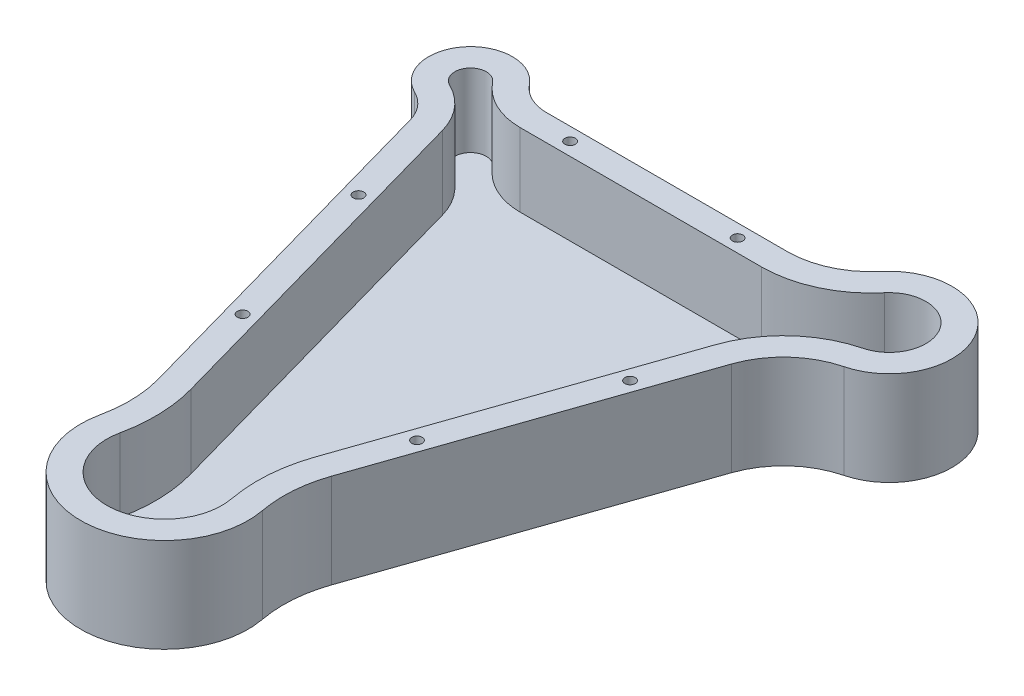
from build123d import *

# Parameters (mm, degrees)
EXTRUDE1_DEPTH                    = 12.7
EXTRUDE_THIN1_DEPTH               = 44.45
F_1_4_28_TAPPED_HOLE1_D           = 5.4102
F_1_4_28_TAPPED_HOLE1_DEPTH       = 15.4202892
F_1_4_28_TAPPED_HOLE1_CBORE_D     = 6.35
F_1_4_28_TAPPED_HOLE1_CBORE_DEPTH = 12.7
F_1_4_28_TAPPED_HOLE1_TIP         = 1.625388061


with BuildPart() as part:
    # Sketch1 → Extrude1 (new body)
    with BuildSketch(Plane(origin=(0, 0, 0), x_dir=(1, 0, 0), z_dir=(0, 1, 0))):
        with BuildLine():
            Line((-110.513625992, 62.787241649), (-50.818057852, -149.612506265))
            ThreePointArc((-50.818057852, -149.612506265), (-48.013269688, -167.841417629), (-49.670330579, -186.210255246))
            ThreePointArc((-49.670330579, -186.210255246), (-0.600829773, -247.660258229), (49.908423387, -187.388091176))
            ThreePointArc((49.908423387, -187.388091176), (48.772721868, -167.634399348), (52.761194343, -148.254248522))
            Line((52.761194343, -148.254248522), (115.169402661, 32.081197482))
            ThreePointArc((115.169402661, 32.081197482), (128.78764256, 52.858628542), (150.629826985, 64.694044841))
            ThreePointArc((150.629826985, 64.694044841), (173.479085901, 121.886333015), (112.036143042, 126.106668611))
            ThreePointArc((112.036143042, 126.106668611), (94.590967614, 112.722401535), (73.124049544, 107.963811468))
            Line((73.124049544, 107.963811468), (-73.124049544, 107.963811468))
            ThreePointArc((-73.124049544, 107.963811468), (-84.122572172, 110.468560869), (-92.951918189, 117.488811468))
            ThreePointArc((-92.951918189, 117.488811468), (-132.6284813, 117.462764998), (-123.873001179, 78.764290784))
            ThreePointArc((-123.873001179, 78.764290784), (-115.480513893, 72.207941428), (-110.513625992, 62.787241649))
        make_face()
    extrude(amount=EXTRUDE1_DEPTH)

    # Sketch2 → Extrude-Thin1 (add)
    with BuildSketch(Plane(origin=(0, 12.7, 0), x_dir=(-1, 0, 0), z_dir=(0, 1, 0))):
        with BuildLine():
            Line((-73.124049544, -107.963811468), (73.124049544, -107.963811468))
            ThreePointArc((73.124049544, -107.963811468), (84.122572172, -110.468560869), (92.951918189, -117.488811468))
            ThreePointArc((92.951918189, -117.488811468), (132.6284813, -117.462764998), (123.873001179, -78.764290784))
            ThreePointArc((123.873001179, -78.764290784), (115.480513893, -72.207941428), (110.513625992, -62.787241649))
            Line((110.513625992, -62.787241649), (50.818057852, 149.612506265))
            ThreePointArc((50.818057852, 149.612506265), (48.013269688, 167.841417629), (49.670330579, 186.210255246))
            ThreePointArc((49.670330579, 186.210255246), (0.600829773, 247.660258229), (-49.908423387, 187.388091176))
            ThreePointArc((-49.908423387, 187.388091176), (-48.772721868, 167.634399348), (-52.761194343, 148.254248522))
            Line((-52.761194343, 148.254248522), (-115.169402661, -32.081197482))
            ThreePointArc((-115.169402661, -32.081197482), (-128.78764256, -52.858628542), (-150.629826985, -64.694044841))
            ThreePointArc((-150.629826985, -64.694044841), (-173.479085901, -121.886333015), (-112.036143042, -126.106668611))
            ThreePointArc((-112.036143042, -126.106668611), (-94.590967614, -112.722401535), (-73.124049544, -107.963811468))
        make_face()
        with BuildLine():
            Line((-73.124049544, -92.088811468), (73.124049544, -92.088811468))
            ThreePointArc((73.124049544, -92.088811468), (90.996648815, -96.159029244), (105.344336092, -107.566936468))
            ThreePointArc((105.344336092, -107.566936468), (120.223047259, -107.557169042), (116.939742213, -93.045241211))
            ThreePointArc((116.939742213, -93.045241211), (103.301950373, -82.391173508), (95.230757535, -67.082536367))
            Line((95.230757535, -67.082536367), (35.535189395, 145.317211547))
            ThreePointArc((35.535189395, 145.317211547), (32.146070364, 167.343812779), (34.148352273, 189.539491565))
            ThreePointArc((34.148352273, 189.539491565), (0.413070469, 231.786368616), (-34.312041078, 190.349253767))
            ThreePointArc((-34.312041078, 190.349253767), (-32.939735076, 166.480209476), (-37.759139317, 143.062527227))
            Line((-37.759139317, 143.062527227), (-100.167347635, -37.272918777))
            ThreePointArc((-100.167347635, -37.272918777), (-118.041287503, -64.543297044), (-146.70915456, -80.077280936))
            ThreePointArc((-146.70915456, -80.077280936), (-160.037888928, -113.439449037), (-124.196172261, -115.901311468))
            ThreePointArc((-124.196172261, -115.901311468), (-101.299379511, -98.334460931), (-73.124049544, -92.088811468))
        make_face(mode=Mode.SUBTRACT)
    extrude(amount=EXTRUDE_THIN1_DEPTH)

    # 1_4-28 Tapped Hole1
    with Locations(Plane(origin=(0, 57.15, 0), x_dir=(-1, 0, 0), z_dir=(0, 1, 0))):
        with Locations((50.8, -100.026311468), (-50.8, -100.026311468), (-93.077779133, 7.48408879), (-59.850762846, 103.497240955), (59.279464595, 90.170164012), (86.769350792, -7.640194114)):
            CounterBoreHole(F_1_4_28_TAPPED_HOLE1_D / 2, F_1_4_28_TAPPED_HOLE1_CBORE_D / 2, F_1_4_28_TAPPED_HOLE1_CBORE_DEPTH, depth=F_1_4_28_TAPPED_HOLE1_DEPTH)
            with Locations((0, 0, -(F_1_4_28_TAPPED_HOLE1_DEPTH + F_1_4_28_TAPPED_HOLE1_TIP / 2))):  # 118° drill point
                Cone(0, F_1_4_28_TAPPED_HOLE1_D / 2, F_1_4_28_TAPPED_HOLE1_TIP, mode=Mode.SUBTRACT)


solid = part.part
